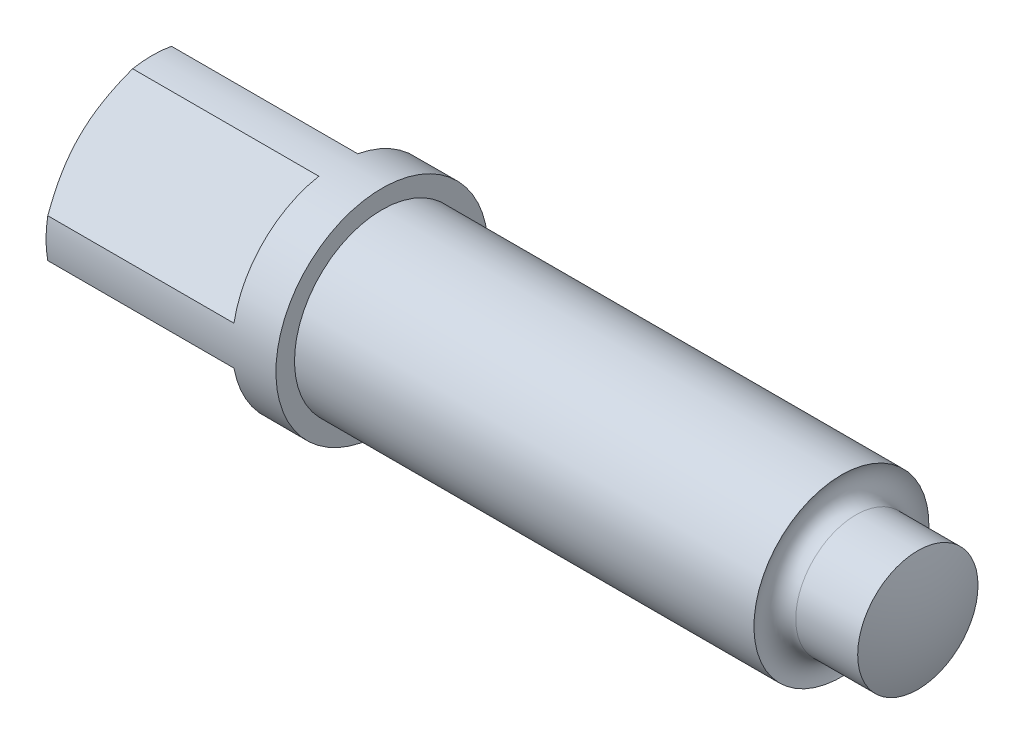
from build123d import *

# Parameters (mm, degrees)
SKETCH1_R          = 4.85
BASEHEAD_DEPTH     = 11
SKETCH2_OUTSIDE_W  = 15.216
SKETCH2_OUTSIDE_H  = 15.216
CUT_EXTRUDE1_DEPTH = 9


with BuildPart() as part:
    # Sketch1 → BaseHead (new body)
    with BuildSketch(Plane(origin=(0, 0, 0), x_dir=(0, 0, -1), z_dir=(1, 0, 0))):
        Circle(SKETCH1_R)
    extrude(amount=BASEHEAD_DEPTH)

    # Sketch2 outside → Cut-Extrude1 (cut)
    with BuildSketch(Plane(origin=(0, -0.474673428, 1.649883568), x_dir=(0, 0, 1), z_dir=(-1, 0, 0))):
        with Locations((-1.65, 0.475)):
            Rectangle(SKETCH2_OUTSIDE_W, SKETCH2_OUTSIDE_H)
        Polygon((4.006970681, 0.474673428), (-1.649883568, 6.131527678), (-7.306737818, 0.474673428), (-1.649883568, -5.182180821), align=None, mode=Mode.SUBTRACT)
    extrude(amount=-CUT_EXTRUDE1_DEPTH, mode=Mode.SUBTRACT)

    # Sketch3 → Cut-Revolve1 (revolve, cut)
    with BuildSketch(Plane(origin=(2.689716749, -8.024716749, 0), x_dir=(0, -1, 0), z_dir=(0, 0, 1)), mode=Mode.PRIVATE) as cut_revolve1_sk:
        Polygon((-13.359716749, -2.689716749), (-12.024716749, -2.689716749), (-13.359716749, -1.918954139), align=None)
    revolve(cut_revolve1_sk.sketch.rotate(Axis((2.975283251, 0, 0), (-1, 0, 0)), 280.562369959), axis=Axis((2.975283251, 0, 0), (-1, 0, 0)), mode=Mode.SUBTRACT)

    # Sketch4 → BaseBody (revolve)
    with BuildSketch(Plane(origin=(-9.880205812, 13.880205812, 0), x_dir=(0, -1, 0), z_dir=(0, 0, 1)), mode=Mode.PRIVATE) as basebody_sk:
        with BuildLine():
            Line((13.880205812, 20.880205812), (17.880205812, 20.880205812))
            Line((17.880205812, 20.880205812), (17.880205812, 41.880205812))
            ThreePointArc((17.880205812, 41.880205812), (17.056040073, 41.834536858), (16.630205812, 42.541643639))
            Line((16.630205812, 42.541643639), (16.630205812, 45.372389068))
            ThreePointArc((16.630205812, 45.372389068), (15.278452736, 45.752187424), (13.880205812, 45.880205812))
            Line((13.880205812, 45.880205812), (13.880205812, 20.880205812))
        make_face()
    revolve(basebody_sk.sketch.rotate(Axis((2.816383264, 0, 0), (-1, 0, 0)), 180), axis=Axis((2.816383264, 0, 0), (-1, 0, 0)))


solid = part.part
